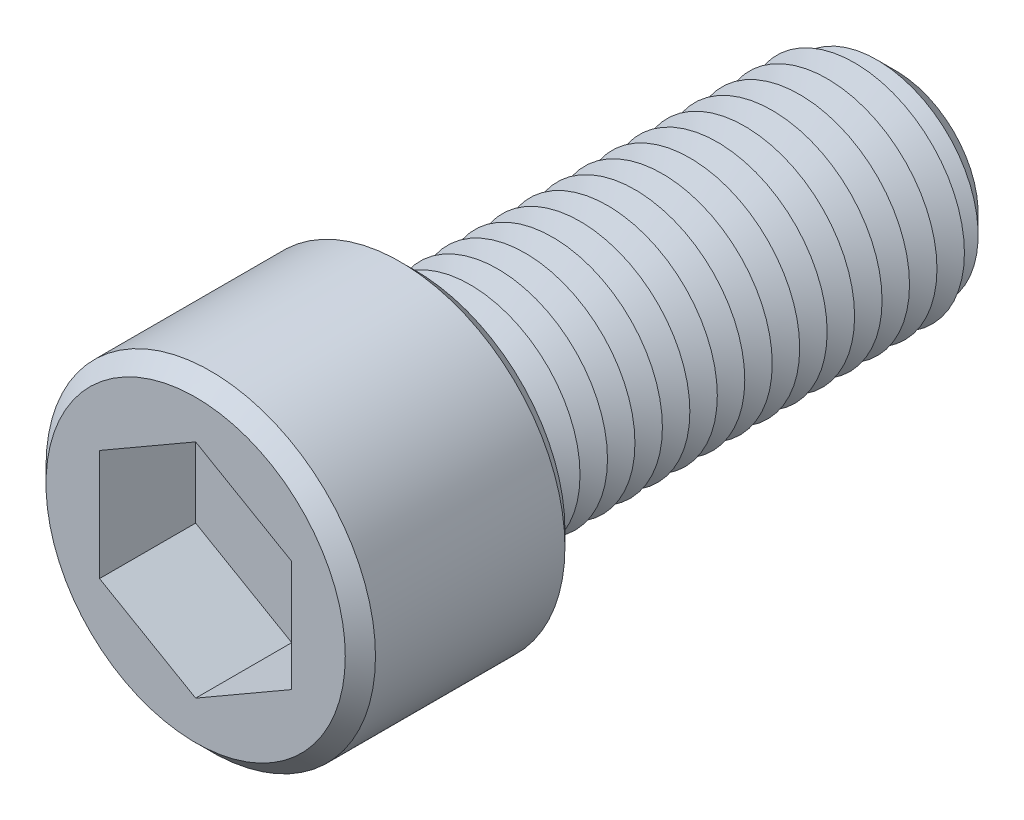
ISO-10303-21;
HEADER;
FILE_DESCRIPTION(('STEP AP214'),'2;1');
FILE_NAME('part.step','',(''),(''),'','','');
FILE_SCHEMA(('AUTOMOTIVE_DESIGN { 1 0 10303 214 1 1 1 1 }'));
ENDSEC;
DATA;
#1=APPLICATION_CONTEXT('core data for automotive mechanical design processes');
#2=APPLICATION_PROTOCOL_DEFINITION('international standard','automotive_design',2000,#1);
#3=PRODUCT_CONTEXT('',#1,'mechanical');
#4=PRODUCT('Part','Part','',(#3));
#5=PRODUCT_RELATED_PRODUCT_CATEGORY('part','',(#4));
#6=PRODUCT_DEFINITION_FORMATION('','',#4);
#7=PRODUCT_DEFINITION_CONTEXT('part definition',#1,'design');
#8=PRODUCT_DEFINITION('design','',#6,#7);
#9=PRODUCT_DEFINITION_SHAPE('','',#8);
#10=(LENGTH_UNIT() NAMED_UNIT(*) SI_UNIT(.MILLI.,.METRE.));
#11=(NAMED_UNIT(*) PLANE_ANGLE_UNIT() SI_UNIT($,.RADIAN.));
#12=(NAMED_UNIT(*) SI_UNIT($,.STERADIAN.) SOLID_ANGLE_UNIT());
#13=UNCERTAINTY_MEASURE_WITH_UNIT(LENGTH_MEASURE(1.E-05),#10,'distance_accuracy_value','');
#14=(GEOMETRIC_REPRESENTATION_CONTEXT(3) GLOBAL_UNCERTAINTY_ASSIGNED_CONTEXT((#13)) GLOBAL_UNIT_ASSIGNED_CONTEXT((#10,
#11,#12)) REPRESENTATION_CONTEXT('',''));
#15=CARTESIAN_POINT('',(0.,0.,0.));
#16=DIRECTION('',(0.,0.,1.));
#17=DIRECTION('',(1.,0.,0.));
#18=AXIS2_PLACEMENT_3D('',#15,#16,#17);
#19=CARTESIAN_POINT('',(0.,0.,16.));
#20=DIRECTION('',(0.,0.,-1.));
#21=DIRECTION('',(-1.,0.,0.));
#22=AXIS2_PLACEMENT_3D('',#19,#20,#21);
#23=CYLINDRICAL_SURFACE('',#22,12.);
#24=CARTESIAN_POINT('',(0.,0.,1.10000000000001));
#25=DIRECTION('',(0.,0.,1.));
#26=DIRECTION('',(1.,0.,0.));
#27=AXIS2_PLACEMENT_3D('',#24,#25,#26);
#28=CIRCLE('',#27,12.);
#29=CARTESIAN_POINT('',(12.,0.,1.10000000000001));
#30=VERTEX_POINT('',#29);
#31=EDGE_CURVE('E312',#30,#30,#28,.T.);
#32=ORIENTED_EDGE('',*,*,#31,.T.);
#33=EDGE_LOOP('',(#32));
#34=FACE_BOUND('',#33,.T.);
#35=CARTESIAN_POINT('',(0.,0.,14.9));
#36=DIRECTION('',(0.,0.,1.));
#37=DIRECTION('',(1.,0.,0.));
#38=AXIS2_PLACEMENT_3D('',#35,#36,#37);
#39=CIRCLE('',#38,12.);
#40=CARTESIAN_POINT('',(12.,0.,14.9));
#41=VERTEX_POINT('',#40);
#42=EDGE_CURVE('E305',#41,#41,#39,.F.);
#43=ORIENTED_EDGE('',*,*,#42,.T.);
#44=EDGE_LOOP('',(#43));
#45=FACE_BOUND('',#44,.T.);
#46=ADVANCED_FACE('F39',(#34,#45),#23,.T.);
#47=CARTESIAN_POINT('',(0.,0.,16.));
#48=DIRECTION('',(0.,0.,1.));
#49=DIRECTION('',(1.,0.,0.));
#50=AXIS2_PLACEMENT_3D('',#47,#48,#49);
#51=PLANE('',#50);
#52=CARTESIAN_POINT('',(0.,0.,16.));
#53=DIRECTION('',(0.,0.,1.));
#54=DIRECTION('',(1.,0.,0.));
#55=AXIS2_PLACEMENT_3D('',#52,#53,#54);
#56=CIRCLE('',#55,10.9);
#57=CARTESIAN_POINT('',(10.9,0.,16.));
#58=VERTEX_POINT('',#57);
#59=EDGE_CURVE('E11',#58,#58,#56,.T.);
#60=ORIENTED_EDGE('',*,*,#59,.T.);
#61=EDGE_LOOP('',(#60));
#62=FACE_BOUND('',#61,.T.);
#63=DIRECTION('',(-0.866025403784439,0.5,0.));
#64=VECTOR('',#63,1.);
#65=CARTESIAN_POINT('',(7.,4.04145188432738,16.));
#66=LINE('',#65,#64);
#67=CARTESIAN_POINT('',(7.,4.04145188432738,16.));
#68=VERTEX_POINT('',#67);
#69=CARTESIAN_POINT('',(0.,8.08290376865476,16.));
#70=VERTEX_POINT('',#69);
#71=EDGE_CURVE('E55',#68,#70,#66,.T.);
#72=ORIENTED_EDGE('',*,*,#71,.F.);
#73=DIRECTION('',(0.,1.,0.));
#74=VECTOR('',#73,1.);
#75=CARTESIAN_POINT('',(7.,-4.04145188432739,16.));
#76=LINE('',#75,#74);
#77=CARTESIAN_POINT('',(7.,-4.04145188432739,16.));
#78=VERTEX_POINT('',#77);
#79=EDGE_CURVE('E151',#78,#68,#76,.T.);
#80=ORIENTED_EDGE('',*,*,#79,.F.);
#81=DIRECTION('',(0.866025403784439,0.5,0.));
#82=VECTOR('',#81,1.);
#83=CARTESIAN_POINT('',(0.,-8.08290376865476,16.));
#84=LINE('',#83,#82);
#85=CARTESIAN_POINT('',(0.,-8.08290376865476,16.));
#86=VERTEX_POINT('',#85);
#87=EDGE_CURVE('E148',#86,#78,#84,.T.);
#88=ORIENTED_EDGE('',*,*,#87,.F.);
#89=DIRECTION('',(0.866025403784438,-0.5,0.));
#90=VECTOR('',#89,1.);
#91=CARTESIAN_POINT('',(-7.,-4.04145188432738,16.));
#92=LINE('',#91,#90);
#93=CARTESIAN_POINT('',(-7.,-4.04145188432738,16.));
#94=VERTEX_POINT('',#93);
#95=EDGE_CURVE('E103',#94,#86,#92,.T.);
#96=ORIENTED_EDGE('',*,*,#95,.F.);
#97=DIRECTION('',(0.,-1.,0.));
#98=VECTOR('',#97,1.);
#99=CARTESIAN_POINT('',(-7.,4.04145188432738,16.));
#100=LINE('',#99,#98);
#101=CARTESIAN_POINT('',(-7.,4.04145188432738,16.));
#102=VERTEX_POINT('',#101);
#103=EDGE_CURVE('E142',#102,#94,#100,.T.);
#104=ORIENTED_EDGE('',*,*,#103,.F.);
#105=DIRECTION('',(-0.866025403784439,-0.5,0.));
#106=VECTOR('',#105,1.);
#107=CARTESIAN_POINT('',(0.,8.08290376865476,16.));
#108=LINE('',#107,#106);
#109=EDGE_CURVE('E137',#70,#102,#108,.T.);
#110=ORIENTED_EDGE('',*,*,#109,.F.);
#111=EDGE_LOOP('',(#72,#80,#88,#96,#104,#110));
#112=FACE_BOUND('',#111,.T.);
#113=ADVANCED_FACE('F331',(#62,#112),#51,.T.);
#114=CARTESIAN_POINT('',(0.,0.,0.));
#115=DIRECTION('',(0.,0.,1.));
#116=DIRECTION('',(1.,0.,0.));
#117=AXIS2_PLACEMENT_3D('',#114,#115,#116);
#118=PLANE('',#117);
#119=CARTESIAN_POINT('',(0.,0.,0.));
#120=DIRECTION('',(0.,0.,1.));
#121=DIRECTION('',(1.,0.,0.));
#122=AXIS2_PLACEMENT_3D('',#119,#120,#121);
#123=CIRCLE('',#122,10.9);
#124=CARTESIAN_POINT('',(10.9,0.,0.));
#125=VERTEX_POINT('',#124);
#126=EDGE_CURVE('E48',#125,#125,#123,.F.);
#127=ORIENTED_EDGE('',*,*,#126,.T.);
#128=EDGE_LOOP('',(#127));
#129=FACE_BOUND('',#128,.T.);
#130=CARTESIAN_POINT('',(0.,0.,0.));
#131=DIRECTION('',(0.,0.,1.));
#132=DIRECTION('',(1.,0.,0.));
#133=AXIS2_PLACEMENT_3D('',#130,#131,#132);
#134=CIRCLE('',#133,8.);
#135=CARTESIAN_POINT('',(8.,0.,0.));
#136=VERTEX_POINT('',#135);
#137=EDGE_CURVE('E297',#136,#136,#134,.T.);
#138=ORIENTED_EDGE('',*,*,#137,.T.);
#139=EDGE_LOOP('',(#138));
#140=FACE_BOUND('',#139,.T.);
#141=ADVANCED_FACE('F320',(#129,#140),#118,.F.);
#142=CARTESIAN_POINT('',(0.,0.,0.));
#143=DIRECTION('',(0.,0.,1.));
#144=DIRECTION('',(1.,0.,0.));
#145=AXIS2_PLACEMENT_3D('',#142,#143,#144);
#146=CONICAL_SURFACE('',#145,8.,1.0471975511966);
#147=CARTESIAN_POINT('',(0.,0.,-1.));
#148=DIRECTION('',(0.,0.,1.));
#149=DIRECTION('',(1.,0.,0.));
#150=AXIS2_PLACEMENT_3D('',#147,#148,#149);
#151=CIRCLE('',#150,6.26794919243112);
#152=CARTESIAN_POINT('',(6.26794919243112,0.,-1.));
#153=VERTEX_POINT('',#152);
#154=EDGE_CURVE('E293',#153,#153,#151,.T.);
#155=ORIENTED_EDGE('',*,*,#154,.T.);
#156=EDGE_LOOP('',(#155));
#157=FACE_BOUND('',#156,.T.);
#158=ORIENTED_EDGE('',*,*,#137,.F.);
#159=EDGE_LOOP('',(#158));
#160=FACE_BOUND('',#159,.T.);
#161=ADVANCED_FACE('F516',(#157,#160),#146,.T.);
#162=CARTESIAN_POINT('',(0.,0.,-1.));
#163=DIRECTION('',(0.,0.,-1.));
#164=DIRECTION('',(-1.,0.,0.));
#165=AXIS2_PLACEMENT_3D('',#162,#163,#164);
#166=CONICAL_SURFACE('',#165,6.26794919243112,1.0471975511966);
#167=CARTESIAN_POINT('',(0.,0.,-2.));
#168=DIRECTION('',(0.,0.,1.));
#169=DIRECTION('',(1.,0.,0.));
#170=AXIS2_PLACEMENT_3D('',#167,#168,#169);
#171=CIRCLE('',#170,8.);
#172=CARTESIAN_POINT('',(8.,0.,-2.));
#173=VERTEX_POINT('',#172);
#174=EDGE_CURVE('E289',#173,#173,#171,.T.);
#175=ORIENTED_EDGE('',*,*,#174,.T.);
#176=EDGE_LOOP('',(#175));
#177=FACE_BOUND('',#176,.T.);
#178=ORIENTED_EDGE('',*,*,#154,.F.);
#179=EDGE_LOOP('',(#178));
#180=FACE_BOUND('',#179,.T.);
#181=ADVANCED_FACE('F512',(#177,#180),#166,.T.);
#182=CARTESIAN_POINT('',(0.,0.,-2.));
#183=DIRECTION('',(0.,0.,1.));
#184=DIRECTION('',(1.,0.,0.));
#185=AXIS2_PLACEMENT_3D('',#182,#183,#184);
#186=CONICAL_SURFACE('',#185,8.,1.0471975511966);
#187=CARTESIAN_POINT('',(0.,0.,-3.));
#188=DIRECTION('',(0.,0.,1.));
#189=DIRECTION('',(1.,0.,0.));
#190=AXIS2_PLACEMENT_3D('',#187,#188,#189);
#191=CIRCLE('',#190,6.26794919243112);
#192=CARTESIAN_POINT('',(6.26794919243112,0.,-3.));
#193=VERTEX_POINT('',#192);
#194=EDGE_CURVE('E285',#193,#193,#191,.T.);
#195=ORIENTED_EDGE('',*,*,#194,.T.);
#196=EDGE_LOOP('',(#195));
#197=FACE_BOUND('',#196,.T.);
#198=ORIENTED_EDGE('',*,*,#174,.F.);
#199=EDGE_LOOP('',(#198));
#200=FACE_BOUND('',#199,.T.);
#201=ADVANCED_FACE('F508',(#197,#200),#186,.T.);
#202=CARTESIAN_POINT('',(0.,0.,-3.));
#203=DIRECTION('',(0.,0.,-1.));
#204=DIRECTION('',(-1.,0.,0.));
#205=AXIS2_PLACEMENT_3D('',#202,#203,#204);
#206=CONICAL_SURFACE('',#205,6.26794919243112,1.0471975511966);
#207=CARTESIAN_POINT('',(0.,0.,-4.));
#208=DIRECTION('',(0.,0.,1.));
#209=DIRECTION('',(1.,0.,0.));
#210=AXIS2_PLACEMENT_3D('',#207,#208,#209);
#211=CIRCLE('',#210,8.);
#212=CARTESIAN_POINT('',(8.,0.,-4.));
#213=VERTEX_POINT('',#212);
#214=EDGE_CURVE('E281',#213,#213,#211,.T.);
#215=ORIENTED_EDGE('',*,*,#214,.T.);
#216=EDGE_LOOP('',(#215));
#217=FACE_BOUND('',#216,.T.);
#218=ORIENTED_EDGE('',*,*,#194,.F.);
#219=EDGE_LOOP('',(#218));
#220=FACE_BOUND('',#219,.T.);
#221=ADVANCED_FACE('F504',(#217,#220),#206,.T.);
#222=CARTESIAN_POINT('',(0.,0.,-4.));
#223=DIRECTION('',(0.,0.,1.));
#224=DIRECTION('',(1.,0.,0.));
#225=AXIS2_PLACEMENT_3D('',#222,#223,#224);
#226=CONICAL_SURFACE('',#225,8.,1.0471975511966);
#227=CARTESIAN_POINT('',(0.,0.,-5.));
#228=DIRECTION('',(0.,0.,1.));
#229=DIRECTION('',(1.,0.,0.));
#230=AXIS2_PLACEMENT_3D('',#227,#228,#229);
#231=CIRCLE('',#230,6.26794919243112);
#232=CARTESIAN_POINT('',(6.26794919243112,0.,-5.));
#233=VERTEX_POINT('',#232);
#234=EDGE_CURVE('E277',#233,#233,#231,.T.);
#235=ORIENTED_EDGE('',*,*,#234,.T.);
#236=EDGE_LOOP('',(#235));
#237=FACE_BOUND('',#236,.T.);
#238=ORIENTED_EDGE('',*,*,#214,.F.);
#239=EDGE_LOOP('',(#238));
#240=FACE_BOUND('',#239,.T.);
#241=ADVANCED_FACE('F500',(#237,#240),#226,.T.);
#242=CARTESIAN_POINT('',(0.,0.,-5.));
#243=DIRECTION('',(0.,0.,-1.));
#244=DIRECTION('',(-1.,0.,0.));
#245=AXIS2_PLACEMENT_3D('',#242,#243,#244);
#246=CONICAL_SURFACE('',#245,6.26794919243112,1.0471975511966);
#247=CARTESIAN_POINT('',(0.,0.,-6.));
#248=DIRECTION('',(0.,0.,1.));
#249=DIRECTION('',(1.,0.,0.));
#250=AXIS2_PLACEMENT_3D('',#247,#248,#249);
#251=CIRCLE('',#250,8.);
#252=CARTESIAN_POINT('',(8.,0.,-6.));
#253=VERTEX_POINT('',#252);
#254=EDGE_CURVE('E273',#253,#253,#251,.T.);
#255=ORIENTED_EDGE('',*,*,#254,.T.);
#256=EDGE_LOOP('',(#255));
#257=FACE_BOUND('',#256,.T.);
#258=ORIENTED_EDGE('',*,*,#234,.F.);
#259=EDGE_LOOP('',(#258));
#260=FACE_BOUND('',#259,.T.);
#261=ADVANCED_FACE('F496',(#257,#260),#246,.T.);
#262=CARTESIAN_POINT('',(0.,0.,-6.));
#263=DIRECTION('',(0.,0.,1.));
#264=DIRECTION('',(1.,0.,0.));
#265=AXIS2_PLACEMENT_3D('',#262,#263,#264);
#266=CONICAL_SURFACE('',#265,8.,1.0471975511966);
#267=CARTESIAN_POINT('',(0.,0.,-7.));
#268=DIRECTION('',(0.,0.,1.));
#269=DIRECTION('',(1.,0.,0.));
#270=AXIS2_PLACEMENT_3D('',#267,#268,#269);
#271=CIRCLE('',#270,6.26794919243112);
#272=CARTESIAN_POINT('',(6.26794919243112,0.,-7.));
#273=VERTEX_POINT('',#272);
#274=EDGE_CURVE('E269',#273,#273,#271,.T.);
#275=ORIENTED_EDGE('',*,*,#274,.T.);
#276=EDGE_LOOP('',(#275));
#277=FACE_BOUND('',#276,.T.);
#278=ORIENTED_EDGE('',*,*,#254,.F.);
#279=EDGE_LOOP('',(#278));
#280=FACE_BOUND('',#279,.T.);
#281=ADVANCED_FACE('F492',(#277,#280),#266,.T.);
#282=CARTESIAN_POINT('',(0.,0.,-7.));
#283=DIRECTION('',(0.,0.,-1.));
#284=DIRECTION('',(-1.,0.,0.));
#285=AXIS2_PLACEMENT_3D('',#282,#283,#284);
#286=CONICAL_SURFACE('',#285,6.26794919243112,1.0471975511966);
#287=CARTESIAN_POINT('',(0.,0.,-8.));
#288=DIRECTION('',(0.,0.,1.));
#289=DIRECTION('',(1.,0.,0.));
#290=AXIS2_PLACEMENT_3D('',#287,#288,#289);
#291=CIRCLE('',#290,8.);
#292=CARTESIAN_POINT('',(8.,0.,-8.));
#293=VERTEX_POINT('',#292);
#294=EDGE_CURVE('E265',#293,#293,#291,.T.);
#295=ORIENTED_EDGE('',*,*,#294,.T.);
#296=EDGE_LOOP('',(#295));
#297=FACE_BOUND('',#296,.T.);
#298=ORIENTED_EDGE('',*,*,#274,.F.);
#299=EDGE_LOOP('',(#298));
#300=FACE_BOUND('',#299,.T.);
#301=ADVANCED_FACE('F488',(#297,#300),#286,.T.);
#302=CARTESIAN_POINT('',(0.,0.,-8.));
#303=DIRECTION('',(0.,0.,1.));
#304=DIRECTION('',(1.,0.,0.));
#305=AXIS2_PLACEMENT_3D('',#302,#303,#304);
#306=CONICAL_SURFACE('',#305,8.,1.0471975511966);
#307=CARTESIAN_POINT('',(0.,0.,-9.));
#308=DIRECTION('',(0.,0.,1.));
#309=DIRECTION('',(1.,0.,0.));
#310=AXIS2_PLACEMENT_3D('',#307,#308,#309);
#311=CIRCLE('',#310,6.26794919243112);
#312=CARTESIAN_POINT('',(6.26794919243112,0.,-9.));
#313=VERTEX_POINT('',#312);
#314=EDGE_CURVE('E261',#313,#313,#311,.T.);
#315=ORIENTED_EDGE('',*,*,#314,.T.);
#316=EDGE_LOOP('',(#315));
#317=FACE_BOUND('',#316,.T.);
#318=ORIENTED_EDGE('',*,*,#294,.F.);
#319=EDGE_LOOP('',(#318));
#320=FACE_BOUND('',#319,.T.);
#321=ADVANCED_FACE('F484',(#317,#320),#306,.T.);
#322=CARTESIAN_POINT('',(0.,0.,-9.));
#323=DIRECTION('',(0.,0.,-1.));
#324=DIRECTION('',(-1.,0.,0.));
#325=AXIS2_PLACEMENT_3D('',#322,#323,#324);
#326=CONICAL_SURFACE('',#325,6.26794919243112,1.0471975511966);
#327=CARTESIAN_POINT('',(0.,0.,-10.));
#328=DIRECTION('',(0.,0.,1.));
#329=DIRECTION('',(1.,0.,0.));
#330=AXIS2_PLACEMENT_3D('',#327,#328,#329);
#331=CIRCLE('',#330,8.);
#332=CARTESIAN_POINT('',(8.,0.,-10.));
#333=VERTEX_POINT('',#332);
#334=EDGE_CURVE('E257',#333,#333,#331,.T.);
#335=ORIENTED_EDGE('',*,*,#334,.T.);
#336=EDGE_LOOP('',(#335));
#337=FACE_BOUND('',#336,.T.);
#338=ORIENTED_EDGE('',*,*,#314,.F.);
#339=EDGE_LOOP('',(#338));
#340=FACE_BOUND('',#339,.T.);
#341=ADVANCED_FACE('F480',(#337,#340),#326,.T.);
#342=CARTESIAN_POINT('',(0.,0.,-10.));
#343=DIRECTION('',(0.,0.,1.));
#344=DIRECTION('',(1.,0.,0.));
#345=AXIS2_PLACEMENT_3D('',#342,#343,#344);
#346=CONICAL_SURFACE('',#345,8.,1.0471975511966);
#347=CARTESIAN_POINT('',(0.,0.,-11.));
#348=DIRECTION('',(0.,0.,1.));
#349=DIRECTION('',(1.,0.,0.));
#350=AXIS2_PLACEMENT_3D('',#347,#348,#349);
#351=CIRCLE('',#350,6.26794919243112);
#352=CARTESIAN_POINT('',(6.26794919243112,0.,-11.));
#353=VERTEX_POINT('',#352);
#354=EDGE_CURVE('E253',#353,#353,#351,.T.);
#355=ORIENTED_EDGE('',*,*,#354,.T.);
#356=EDGE_LOOP('',(#355));
#357=FACE_BOUND('',#356,.T.);
#358=ORIENTED_EDGE('',*,*,#334,.F.);
#359=EDGE_LOOP('',(#358));
#360=FACE_BOUND('',#359,.T.);
#361=ADVANCED_FACE('F476',(#357,#360),#346,.T.);
#362=CARTESIAN_POINT('',(0.,0.,-11.));
#363=DIRECTION('',(0.,0.,-1.));
#364=DIRECTION('',(-1.,0.,0.));
#365=AXIS2_PLACEMENT_3D('',#362,#363,#364);
#366=CONICAL_SURFACE('',#365,6.26794919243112,1.0471975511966);
#367=CARTESIAN_POINT('',(0.,0.,-12.));
#368=DIRECTION('',(0.,0.,1.));
#369=DIRECTION('',(1.,0.,0.));
#370=AXIS2_PLACEMENT_3D('',#367,#368,#369);
#371=CIRCLE('',#370,8.);
#372=CARTESIAN_POINT('',(8.,0.,-12.));
#373=VERTEX_POINT('',#372);
#374=EDGE_CURVE('E249',#373,#373,#371,.T.);
#375=ORIENTED_EDGE('',*,*,#374,.T.);
#376=EDGE_LOOP('',(#375));
#377=FACE_BOUND('',#376,.T.);
#378=ORIENTED_EDGE('',*,*,#354,.F.);
#379=EDGE_LOOP('',(#378));
#380=FACE_BOUND('',#379,.T.);
#381=ADVANCED_FACE('F472',(#377,#380),#366,.T.);
#382=CARTESIAN_POINT('',(0.,0.,-12.));
#383=DIRECTION('',(0.,0.,1.));
#384=DIRECTION('',(1.,0.,0.));
#385=AXIS2_PLACEMENT_3D('',#382,#383,#384);
#386=CONICAL_SURFACE('',#385,8.,1.0471975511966);
#387=CARTESIAN_POINT('',(0.,0.,-13.));
#388=DIRECTION('',(0.,0.,1.));
#389=DIRECTION('',(1.,0.,0.));
#390=AXIS2_PLACEMENT_3D('',#387,#388,#389);
#391=CIRCLE('',#390,6.26794919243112);
#392=CARTESIAN_POINT('',(6.26794919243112,0.,-13.));
#393=VERTEX_POINT('',#392);
#394=EDGE_CURVE('E245',#393,#393,#391,.T.);
#395=ORIENTED_EDGE('',*,*,#394,.T.);
#396=EDGE_LOOP('',(#395));
#397=FACE_BOUND('',#396,.T.);
#398=ORIENTED_EDGE('',*,*,#374,.F.);
#399=EDGE_LOOP('',(#398));
#400=FACE_BOUND('',#399,.T.);
#401=ADVANCED_FACE('F468',(#397,#400),#386,.T.);
#402=CARTESIAN_POINT('',(0.,0.,-13.));
#403=DIRECTION('',(0.,0.,-1.));
#404=DIRECTION('',(-1.,0.,0.));
#405=AXIS2_PLACEMENT_3D('',#402,#403,#404);
#406=CONICAL_SURFACE('',#405,6.26794919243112,1.0471975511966);
#407=CARTESIAN_POINT('',(0.,0.,-14.));
#408=DIRECTION('',(0.,0.,1.));
#409=DIRECTION('',(1.,0.,0.));
#410=AXIS2_PLACEMENT_3D('',#407,#408,#409);
#411=CIRCLE('',#410,8.);
#412=CARTESIAN_POINT('',(8.,0.,-14.));
#413=VERTEX_POINT('',#412);
#414=EDGE_CURVE('E241',#413,#413,#411,.T.);
#415=ORIENTED_EDGE('',*,*,#414,.T.);
#416=EDGE_LOOP('',(#415));
#417=FACE_BOUND('',#416,.T.);
#418=ORIENTED_EDGE('',*,*,#394,.F.);
#419=EDGE_LOOP('',(#418));
#420=FACE_BOUND('',#419,.T.);
#421=ADVANCED_FACE('F464',(#417,#420),#406,.T.);
#422=CARTESIAN_POINT('',(0.,0.,-14.));
#423=DIRECTION('',(0.,0.,1.));
#424=DIRECTION('',(1.,0.,0.));
#425=AXIS2_PLACEMENT_3D('',#422,#423,#424);
#426=CONICAL_SURFACE('',#425,8.,1.0471975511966);
#427=CARTESIAN_POINT('',(0.,0.,-15.));
#428=DIRECTION('',(0.,0.,1.));
#429=DIRECTION('',(1.,0.,0.));
#430=AXIS2_PLACEMENT_3D('',#427,#428,#429);
#431=CIRCLE('',#430,6.26794919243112);
#432=CARTESIAN_POINT('',(6.26794919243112,0.,-15.));
#433=VERTEX_POINT('',#432);
#434=EDGE_CURVE('E237',#433,#433,#431,.T.);
#435=ORIENTED_EDGE('',*,*,#434,.T.);
#436=EDGE_LOOP('',(#435));
#437=FACE_BOUND('',#436,.T.);
#438=ORIENTED_EDGE('',*,*,#414,.F.);
#439=EDGE_LOOP('',(#438));
#440=FACE_BOUND('',#439,.T.);
#441=ADVANCED_FACE('F460',(#437,#440),#426,.T.);
#442=CARTESIAN_POINT('',(0.,0.,-15.));
#443=DIRECTION('',(0.,0.,-1.));
#444=DIRECTION('',(-1.,0.,0.));
#445=AXIS2_PLACEMENT_3D('',#442,#443,#444);
#446=CONICAL_SURFACE('',#445,6.26794919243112,1.0471975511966);
#447=CARTESIAN_POINT('',(0.,0.,-16.));
#448=DIRECTION('',(0.,0.,1.));
#449=DIRECTION('',(1.,0.,0.));
#450=AXIS2_PLACEMENT_3D('',#447,#448,#449);
#451=CIRCLE('',#450,8.);
#452=CARTESIAN_POINT('',(8.,0.,-16.));
#453=VERTEX_POINT('',#452);
#454=EDGE_CURVE('E233',#453,#453,#451,.T.);
#455=ORIENTED_EDGE('',*,*,#454,.T.);
#456=EDGE_LOOP('',(#455));
#457=FACE_BOUND('',#456,.T.);
#458=ORIENTED_EDGE('',*,*,#434,.F.);
#459=EDGE_LOOP('',(#458));
#460=FACE_BOUND('',#459,.T.);
#461=ADVANCED_FACE('F456',(#457,#460),#446,.T.);
#462=CARTESIAN_POINT('',(0.,0.,-16.));
#463=DIRECTION('',(0.,0.,1.));
#464=DIRECTION('',(1.,0.,0.));
#465=AXIS2_PLACEMENT_3D('',#462,#463,#464);
#466=CONICAL_SURFACE('',#465,8.,1.0471975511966);
#467=CARTESIAN_POINT('',(0.,0.,-17.));
#468=DIRECTION('',(0.,0.,1.));
#469=DIRECTION('',(1.,0.,0.));
#470=AXIS2_PLACEMENT_3D('',#467,#468,#469);
#471=CIRCLE('',#470,6.26794919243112);
#472=CARTESIAN_POINT('',(6.26794919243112,0.,-17.));
#473=VERTEX_POINT('',#472);
#474=EDGE_CURVE('E229',#473,#473,#471,.T.);
#475=ORIENTED_EDGE('',*,*,#474,.T.);
#476=EDGE_LOOP('',(#475));
#477=FACE_BOUND('',#476,.T.);
#478=ORIENTED_EDGE('',*,*,#454,.F.);
#479=EDGE_LOOP('',(#478));
#480=FACE_BOUND('',#479,.T.);
#481=ADVANCED_FACE('F452',(#477,#480),#466,.T.);
#482=CARTESIAN_POINT('',(0.,0.,-17.));
#483=DIRECTION('',(0.,0.,-1.));
#484=DIRECTION('',(-1.,0.,0.));
#485=AXIS2_PLACEMENT_3D('',#482,#483,#484);
#486=CONICAL_SURFACE('',#485,6.26794919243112,1.0471975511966);
#487=CARTESIAN_POINT('',(0.,0.,-18.));
#488=DIRECTION('',(0.,0.,1.));
#489=DIRECTION('',(1.,0.,0.));
#490=AXIS2_PLACEMENT_3D('',#487,#488,#489);
#491=CIRCLE('',#490,8.);
#492=CARTESIAN_POINT('',(8.,0.,-18.));
#493=VERTEX_POINT('',#492);
#494=EDGE_CURVE('E225',#493,#493,#491,.T.);
#495=ORIENTED_EDGE('',*,*,#494,.T.);
#496=EDGE_LOOP('',(#495));
#497=FACE_BOUND('',#496,.T.);
#498=ORIENTED_EDGE('',*,*,#474,.F.);
#499=EDGE_LOOP('',(#498));
#500=FACE_BOUND('',#499,.T.);
#501=ADVANCED_FACE('F448',(#497,#500),#486,.T.);
#502=CARTESIAN_POINT('',(0.,0.,-18.));
#503=DIRECTION('',(0.,0.,1.));
#504=DIRECTION('',(1.,0.,0.));
#505=AXIS2_PLACEMENT_3D('',#502,#503,#504);
#506=CONICAL_SURFACE('',#505,8.,1.0471975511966);
#507=CARTESIAN_POINT('',(0.,0.,-19.));
#508=DIRECTION('',(0.,0.,1.));
#509=DIRECTION('',(1.,0.,0.));
#510=AXIS2_PLACEMENT_3D('',#507,#508,#509);
#511=CIRCLE('',#510,6.26794919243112);
#512=CARTESIAN_POINT('',(6.26794919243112,0.,-19.));
#513=VERTEX_POINT('',#512);
#514=EDGE_CURVE('E221',#513,#513,#511,.T.);
#515=ORIENTED_EDGE('',*,*,#514,.T.);
#516=EDGE_LOOP('',(#515));
#517=FACE_BOUND('',#516,.T.);
#518=ORIENTED_EDGE('',*,*,#494,.F.);
#519=EDGE_LOOP('',(#518));
#520=FACE_BOUND('',#519,.T.);
#521=ADVANCED_FACE('F444',(#517,#520),#506,.T.);
#522=CARTESIAN_POINT('',(0.,0.,-19.));
#523=DIRECTION('',(0.,0.,-1.));
#524=DIRECTION('',(-1.,0.,0.));
#525=AXIS2_PLACEMENT_3D('',#522,#523,#524);
#526=CONICAL_SURFACE('',#525,6.26794919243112,1.0471975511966);
#527=CARTESIAN_POINT('',(0.,0.,-20.));
#528=DIRECTION('',(0.,0.,1.));
#529=DIRECTION('',(1.,0.,0.));
#530=AXIS2_PLACEMENT_3D('',#527,#528,#529);
#531=CIRCLE('',#530,8.);
#532=CARTESIAN_POINT('',(8.,0.,-20.));
#533=VERTEX_POINT('',#532);
#534=EDGE_CURVE('E217',#533,#533,#531,.T.);
#535=ORIENTED_EDGE('',*,*,#534,.T.);
#536=EDGE_LOOP('',(#535));
#537=FACE_BOUND('',#536,.T.);
#538=ORIENTED_EDGE('',*,*,#514,.F.);
#539=EDGE_LOOP('',(#538));
#540=FACE_BOUND('',#539,.T.);
#541=ADVANCED_FACE('F440',(#537,#540),#526,.T.);
#542=CARTESIAN_POINT('',(0.,0.,-20.));
#543=DIRECTION('',(0.,0.,1.));
#544=DIRECTION('',(1.,0.,0.));
#545=AXIS2_PLACEMENT_3D('',#542,#543,#544);
#546=CONICAL_SURFACE('',#545,8.,1.0471975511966);
#547=CARTESIAN_POINT('',(0.,0.,-21.));
#548=DIRECTION('',(0.,0.,1.));
#549=DIRECTION('',(1.,0.,0.));
#550=AXIS2_PLACEMENT_3D('',#547,#548,#549);
#551=CIRCLE('',#550,6.26794919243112);
#552=CARTESIAN_POINT('',(6.26794919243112,0.,-21.));
#553=VERTEX_POINT('',#552);
#554=EDGE_CURVE('E213',#553,#553,#551,.T.);
#555=ORIENTED_EDGE('',*,*,#554,.T.);
#556=EDGE_LOOP('',(#555));
#557=FACE_BOUND('',#556,.T.);
#558=ORIENTED_EDGE('',*,*,#534,.F.);
#559=EDGE_LOOP('',(#558));
#560=FACE_BOUND('',#559,.T.);
#561=ADVANCED_FACE('F436',(#557,#560),#546,.T.);
#562=CARTESIAN_POINT('',(0.,0.,-21.));
#563=DIRECTION('',(0.,0.,-1.));
#564=DIRECTION('',(-1.,0.,0.));
#565=AXIS2_PLACEMENT_3D('',#562,#563,#564);
#566=CONICAL_SURFACE('',#565,6.26794919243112,1.0471975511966);
#567=CARTESIAN_POINT('',(0.,0.,-22.));
#568=DIRECTION('',(0.,0.,1.));
#569=DIRECTION('',(1.,0.,0.));
#570=AXIS2_PLACEMENT_3D('',#567,#568,#569);
#571=CIRCLE('',#570,8.);
#572=CARTESIAN_POINT('',(8.,0.,-22.));
#573=VERTEX_POINT('',#572);
#574=EDGE_CURVE('E209',#573,#573,#571,.T.);
#575=ORIENTED_EDGE('',*,*,#574,.T.);
#576=EDGE_LOOP('',(#575));
#577=FACE_BOUND('',#576,.T.);
#578=ORIENTED_EDGE('',*,*,#554,.F.);
#579=EDGE_LOOP('',(#578));
#580=FACE_BOUND('',#579,.T.);
#581=ADVANCED_FACE('F432',(#577,#580),#566,.T.);
#582=CARTESIAN_POINT('',(0.,0.,-22.));
#583=DIRECTION('',(0.,0.,1.));
#584=DIRECTION('',(1.,0.,0.));
#585=AXIS2_PLACEMENT_3D('',#582,#583,#584);
#586=CONICAL_SURFACE('',#585,8.,1.0471975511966);
#587=CARTESIAN_POINT('',(0.,0.,-23.));
#588=DIRECTION('',(0.,0.,1.));
#589=DIRECTION('',(1.,0.,0.));
#590=AXIS2_PLACEMENT_3D('',#587,#588,#589);
#591=CIRCLE('',#590,6.26794919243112);
#592=CARTESIAN_POINT('',(6.26794919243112,0.,-23.));
#593=VERTEX_POINT('',#592);
#594=EDGE_CURVE('E205',#593,#593,#591,.T.);
#595=ORIENTED_EDGE('',*,*,#594,.T.);
#596=EDGE_LOOP('',(#595));
#597=FACE_BOUND('',#596,.T.);
#598=ORIENTED_EDGE('',*,*,#574,.F.);
#599=EDGE_LOOP('',(#598));
#600=FACE_BOUND('',#599,.T.);
#601=ADVANCED_FACE('F428',(#597,#600),#586,.T.);
#602=CARTESIAN_POINT('',(0.,0.,-23.));
#603=DIRECTION('',(0.,0.,-1.));
#604=DIRECTION('',(-1.,0.,0.));
#605=AXIS2_PLACEMENT_3D('',#602,#603,#604);
#606=CONICAL_SURFACE('',#605,6.26794919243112,1.0471975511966);
#607=CARTESIAN_POINT('',(0.,0.,-24.));
#608=DIRECTION('',(0.,0.,1.));
#609=DIRECTION('',(1.,0.,0.));
#610=AXIS2_PLACEMENT_3D('',#607,#608,#609);
#611=CIRCLE('',#610,8.);
#612=CARTESIAN_POINT('',(8.,0.,-24.));
#613=VERTEX_POINT('',#612);
#614=EDGE_CURVE('E201',#613,#613,#611,.T.);
#615=ORIENTED_EDGE('',*,*,#614,.T.);
#616=EDGE_LOOP('',(#615));
#617=FACE_BOUND('',#616,.T.);
#618=ORIENTED_EDGE('',*,*,#594,.F.);
#619=EDGE_LOOP('',(#618));
#620=FACE_BOUND('',#619,.T.);
#621=ADVANCED_FACE('F424',(#617,#620),#606,.T.);
#622=CARTESIAN_POINT('',(0.,0.,-24.));
#623=DIRECTION('',(0.,0.,1.));
#624=DIRECTION('',(1.,0.,0.));
#625=AXIS2_PLACEMENT_3D('',#622,#623,#624);
#626=CONICAL_SURFACE('',#625,8.,1.0471975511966);
#627=CARTESIAN_POINT('',(0.,0.,-25.));
#628=DIRECTION('',(0.,0.,1.));
#629=DIRECTION('',(1.,0.,0.));
#630=AXIS2_PLACEMENT_3D('',#627,#628,#629);
#631=CIRCLE('',#630,6.26794919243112);
#632=CARTESIAN_POINT('',(6.26794919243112,0.,-25.));
#633=VERTEX_POINT('',#632);
#634=EDGE_CURVE('E197',#633,#633,#631,.T.);
#635=ORIENTED_EDGE('',*,*,#634,.T.);
#636=EDGE_LOOP('',(#635));
#637=FACE_BOUND('',#636,.T.);
#638=ORIENTED_EDGE('',*,*,#614,.F.);
#639=EDGE_LOOP('',(#638));
#640=FACE_BOUND('',#639,.T.);
#641=ADVANCED_FACE('F420',(#637,#640),#626,.T.);
#642=CARTESIAN_POINT('',(0.,0.,-25.));
#643=DIRECTION('',(0.,0.,-1.));
#644=DIRECTION('',(-1.,0.,0.));
#645=AXIS2_PLACEMENT_3D('',#642,#643,#644);
#646=CONICAL_SURFACE('',#645,6.26794919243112,1.0471975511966);
#647=CARTESIAN_POINT('',(0.,0.,-26.));
#648=DIRECTION('',(0.,0.,1.));
#649=DIRECTION('',(1.,0.,0.));
#650=AXIS2_PLACEMENT_3D('',#647,#648,#649);
#651=CIRCLE('',#650,8.);
#652=CARTESIAN_POINT('',(8.,0.,-26.));
#653=VERTEX_POINT('',#652);
#654=EDGE_CURVE('E193',#653,#653,#651,.T.);
#655=ORIENTED_EDGE('',*,*,#654,.T.);
#656=EDGE_LOOP('',(#655));
#657=FACE_BOUND('',#656,.T.);
#658=ORIENTED_EDGE('',*,*,#634,.F.);
#659=EDGE_LOOP('',(#658));
#660=FACE_BOUND('',#659,.T.);
#661=ADVANCED_FACE('F416',(#657,#660),#646,.T.);
#662=CARTESIAN_POINT('',(0.,0.,-26.));
#663=DIRECTION('',(0.,0.,1.));
#664=DIRECTION('',(1.,0.,0.));
#665=AXIS2_PLACEMENT_3D('',#662,#663,#664);
#666=CONICAL_SURFACE('',#665,8.,1.0471975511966);
#667=CARTESIAN_POINT('',(0.,0.,-27.));
#668=DIRECTION('',(0.,0.,1.));
#669=DIRECTION('',(1.,0.,0.));
#670=AXIS2_PLACEMENT_3D('',#667,#668,#669);
#671=CIRCLE('',#670,6.26794919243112);
#672=CARTESIAN_POINT('',(6.26794919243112,0.,-27.));
#673=VERTEX_POINT('',#672);
#674=EDGE_CURVE('E189',#673,#673,#671,.T.);
#675=ORIENTED_EDGE('',*,*,#674,.T.);
#676=EDGE_LOOP('',(#675));
#677=FACE_BOUND('',#676,.T.);
#678=ORIENTED_EDGE('',*,*,#654,.F.);
#679=EDGE_LOOP('',(#678));
#680=FACE_BOUND('',#679,.T.);
#681=ADVANCED_FACE('F412',(#677,#680),#666,.T.);
#682=CARTESIAN_POINT('',(0.,0.,-27.));
#683=DIRECTION('',(0.,0.,-1.));
#684=DIRECTION('',(-1.,0.,0.));
#685=AXIS2_PLACEMENT_3D('',#682,#683,#684);
#686=CONICAL_SURFACE('',#685,6.26794919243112,1.0471975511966);
#687=CARTESIAN_POINT('',(0.,0.,-28.));
#688=DIRECTION('',(0.,0.,1.));
#689=DIRECTION('',(1.,0.,0.));
#690=AXIS2_PLACEMENT_3D('',#687,#688,#689);
#691=CIRCLE('',#690,8.);
#692=CARTESIAN_POINT('',(8.,0.,-28.));
#693=VERTEX_POINT('',#692);
#694=EDGE_CURVE('E186',#693,#693,#691,.T.);
#695=ORIENTED_EDGE('',*,*,#694,.T.);
#696=EDGE_LOOP('',(#695));
#697=FACE_BOUND('',#696,.T.);
#698=ORIENTED_EDGE('',*,*,#674,.F.);
#699=EDGE_LOOP('',(#698));
#700=FACE_BOUND('',#699,.T.);
#701=ADVANCED_FACE('F408',(#697,#700),#686,.T.);
#702=CARTESIAN_POINT('',(0.,0.,-28.));
#703=DIRECTION('',(0.,0.,1.));
#704=DIRECTION('',(1.,0.,0.));
#705=AXIS2_PLACEMENT_3D('',#702,#703,#704);
#706=CONICAL_SURFACE('',#705,8.,1.0471975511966);
#707=CARTESIAN_POINT('',(0.,0.,-29.));
#708=DIRECTION('',(0.,0.,1.));
#709=DIRECTION('',(1.,0.,0.));
#710=AXIS2_PLACEMENT_3D('',#707,#708,#709);
#711=CIRCLE('',#710,6.26794919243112);
#712=CARTESIAN_POINT('',(6.26794919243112,0.,-29.));
#713=VERTEX_POINT('',#712);
#714=EDGE_CURVE('E182',#713,#713,#711,.T.);
#715=ORIENTED_EDGE('',*,*,#714,.T.);
#716=EDGE_LOOP('',(#715));
#717=FACE_BOUND('',#716,.T.);
#718=ORIENTED_EDGE('',*,*,#694,.F.);
#719=EDGE_LOOP('',(#718));
#720=FACE_BOUND('',#719,.T.);
#721=ADVANCED_FACE('F404',(#717,#720),#706,.T.);
#722=CARTESIAN_POINT('',(0.,0.,-29.));
#723=DIRECTION('',(0.,0.,-1.));
#724=DIRECTION('',(-1.,0.,0.));
#725=AXIS2_PLACEMENT_3D('',#722,#723,#724);
#726=CONICAL_SURFACE('',#725,6.26794919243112,1.0471975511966);
#727=CARTESIAN_POINT('',(0.,0.,-30.));
#728=DIRECTION('',(0.,0.,1.));
#729=DIRECTION('',(1.,0.,0.));
#730=AXIS2_PLACEMENT_3D('',#727,#728,#729);
#731=CIRCLE('',#730,8.);
#732=CARTESIAN_POINT('',(8.,0.,-30.));
#733=VERTEX_POINT('',#732);
#734=EDGE_CURVE('E178',#733,#733,#731,.T.);
#735=ORIENTED_EDGE('',*,*,#734,.T.);
#736=EDGE_LOOP('',(#735));
#737=FACE_BOUND('',#736,.T.);
#738=ORIENTED_EDGE('',*,*,#714,.F.);
#739=EDGE_LOOP('',(#738));
#740=FACE_BOUND('',#739,.T.);
#741=ADVANCED_FACE('F400',(#737,#740),#726,.T.);
#742=CARTESIAN_POINT('',(0.,0.,-30.));
#743=DIRECTION('',(0.,0.,1.));
#744=DIRECTION('',(1.,0.,0.));
#745=AXIS2_PLACEMENT_3D('',#742,#743,#744);
#746=CONICAL_SURFACE('',#745,8.,1.0471975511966);
#747=CARTESIAN_POINT('',(0.,0.,-31.));
#748=DIRECTION('',(0.,0.,1.));
#749=DIRECTION('',(1.,0.,0.));
#750=AXIS2_PLACEMENT_3D('',#747,#748,#749);
#751=CIRCLE('',#750,6.26794919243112);
#752=CARTESIAN_POINT('',(6.26794919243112,0.,-31.));
#753=VERTEX_POINT('',#752);
#754=EDGE_CURVE('E174',#753,#753,#751,.T.);
#755=ORIENTED_EDGE('',*,*,#754,.T.);
#756=EDGE_LOOP('',(#755));
#757=FACE_BOUND('',#756,.T.);
#758=ORIENTED_EDGE('',*,*,#734,.F.);
#759=EDGE_LOOP('',(#758));
#760=FACE_BOUND('',#759,.T.);
#761=ADVANCED_FACE('F396',(#757,#760),#746,.T.);
#762=CARTESIAN_POINT('',(0.,0.,-31.));
#763=DIRECTION('',(0.,0.,-1.));
#764=DIRECTION('',(-1.,0.,0.));
#765=AXIS2_PLACEMENT_3D('',#762,#763,#764);
#766=CONICAL_SURFACE('',#765,6.26794919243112,1.0471975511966);
#767=CARTESIAN_POINT('',(0.,0.,-32.));
#768=DIRECTION('',(0.,0.,1.));
#769=DIRECTION('',(1.,0.,0.));
#770=AXIS2_PLACEMENT_3D('',#767,#768,#769);
#771=CIRCLE('',#770,8.);
#772=CARTESIAN_POINT('',(8.,0.,-32.));
#773=VERTEX_POINT('',#772);
#774=EDGE_CURVE('E169',#773,#773,#771,.T.);
#775=ORIENTED_EDGE('',*,*,#774,.T.);
#776=EDGE_LOOP('',(#775));
#777=FACE_BOUND('',#776,.T.);
#778=ORIENTED_EDGE('',*,*,#754,.F.);
#779=EDGE_LOOP('',(#778));
#780=FACE_BOUND('',#779,.T.);
#781=ADVANCED_FACE('F392',(#777,#780),#766,.T.);
#782=CARTESIAN_POINT('',(0.,0.,-32.));
#783=DIRECTION('',(0.,0.,1.));
#784=DIRECTION('',(1.,0.,0.));
#785=AXIS2_PLACEMENT_3D('',#782,#783,#784);
#786=CONICAL_SURFACE('',#785,8.,1.0471975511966);
#787=CARTESIAN_POINT('',(0.,0.,-33.));
#788=DIRECTION('',(0.,0.,1.));
#789=DIRECTION('',(1.,0.,0.));
#790=AXIS2_PLACEMENT_3D('',#787,#788,#789);
#791=CIRCLE('',#790,6.26794919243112);
#792=CARTESIAN_POINT('',(6.26794919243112,0.,-33.));
#793=VERTEX_POINT('',#792);
#794=EDGE_CURVE('E157',#793,#793,#791,.T.);
#795=ORIENTED_EDGE('',*,*,#794,.T.);
#796=EDGE_LOOP('',(#795));
#797=FACE_BOUND('',#796,.T.);
#798=ORIENTED_EDGE('',*,*,#774,.F.);
#799=EDGE_LOOP('',(#798));
#800=FACE_BOUND('',#799,.T.);
#801=ADVANCED_FACE('F388',(#797,#800),#786,.T.);
#802=CARTESIAN_POINT('',(0.,0.,-33.));
#803=DIRECTION('',(0.,0.,-1.));
#804=DIRECTION('',(-1.,0.,0.));
#805=AXIS2_PLACEMENT_3D('',#802,#803,#804);
#806=CONICAL_SURFACE('',#805,6.26794919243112,1.0471975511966);
#807=CARTESIAN_POINT('',(0.,0.,-33.6339745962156));
#808=DIRECTION('',(0.,0.,-1.));
#809=DIRECTION('',(-1.,0.,0.));
#810=AXIS2_PLACEMENT_3D('',#807,#808,#809);
#811=CIRCLE('',#810,7.36602540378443);
#812=CARTESIAN_POINT('',(-7.36602540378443,0.,-33.6339745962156));
#813=VERTEX_POINT('',#812);
#814=EDGE_CURVE('E173',#813,#813,#811,.T.);
#815=ORIENTED_EDGE('',*,*,#814,.F.);
#816=EDGE_LOOP('',(#815));
#817=FACE_BOUND('',#816,.T.);
#818=ORIENTED_EDGE('',*,*,#794,.F.);
#819=EDGE_LOOP('',(#818));
#820=FACE_BOUND('',#819,.T.);
#821=ADVANCED_FACE('F384',(#817,#820),#806,.T.);
#822=CARTESIAN_POINT('',(0.,0.,-35.));
#823=DIRECTION('',(0.,0.,-1.));
#824=DIRECTION('',(-1.,0.,0.));
#825=AXIS2_PLACEMENT_3D('',#822,#823,#824);
#826=PLANE('',#825);
#827=CARTESIAN_POINT('',(0.,0.,-35.));
#828=DIRECTION('',(0.,0.,-1.));
#829=DIRECTION('',(-1.,0.,0.));
#830=AXIS2_PLACEMENT_3D('',#827,#828,#829);
#831=CIRCLE('',#830,0.9);
#832=CARTESIAN_POINT('',(0.9,0.,-35.));
#833=VERTEX_POINT('',#832);
#834=EDGE_CURVE('E138',#833,#833,#831,.F.);
#835=ORIENTED_EDGE('',*,*,#834,.T.);
#836=EDGE_LOOP('',(#835));
#837=FACE_BOUND('',#836,.T.);
#838=CARTESIAN_POINT('',(0.,0.,-35.));
#839=DIRECTION('',(0.,0.,-1.));
#840=DIRECTION('',(-1.,0.,0.));
#841=AXIS2_PLACEMENT_3D('',#838,#839,#840);
#842=CIRCLE('',#841,5.99999999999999);
#843=CARTESIAN_POINT('',(-5.99999999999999,0.,-35.));
#844=VERTEX_POINT('',#843);
#845=EDGE_CURVE('E301',#844,#844,#842,.T.);
#846=ORIENTED_EDGE('',*,*,#845,.T.);
#847=EDGE_LOOP('',(#846));
#848=FACE_BOUND('',#847,.T.);
#849=ADVANCED_FACE('F387',(#837,#848),#826,.T.);
#850=CARTESIAN_POINT('',(0.,0.,-35.));
#851=DIRECTION('',(0.,0.,1.));
#852=DIRECTION('',(1.,0.,0.));
#853=AXIS2_PLACEMENT_3D('',#850,#851,#852);
#854=CONICAL_SURFACE('',#853,5.99999999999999,0.785398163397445);
#855=ORIENTED_EDGE('',*,*,#845,.F.);
#856=EDGE_LOOP('',(#855));
#857=FACE_BOUND('',#856,.T.);
#858=ORIENTED_EDGE('',*,*,#814,.T.);
#859=EDGE_LOOP('',(#858));
#860=FACE_BOUND('',#859,.T.);
#861=ADVANCED_FACE('F383',(#857,#860),#854,.T.);
#862=CARTESIAN_POINT('',(7.,4.04145188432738,9.));
#863=DIRECTION('',(0.5,0.866025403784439,0.));
#864=DIRECTION('',(-0.866025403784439,0.5,0.));
#865=AXIS2_PLACEMENT_3D('',#862,#863,#864);
#866=PLANE('',#865);
#867=ORIENTED_EDGE('',*,*,#71,.T.);
#868=DIRECTION('',(0.,0.,1.));
#869=VECTOR('',#868,1.);
#870=CARTESIAN_POINT('',(0.,8.08290376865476,9.));
#871=LINE('',#870,#869);
#872=CARTESIAN_POINT('',(0.,8.08290376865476,9.));
#873=VERTEX_POINT('',#872);
#874=EDGE_CURVE('E85',#873,#70,#871,.T.);
#875=ORIENTED_EDGE('',*,*,#874,.F.);
#876=DIRECTION('',(-0.866025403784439,0.5,0.));
#877=VECTOR('',#876,1.);
#878=CARTESIAN_POINT('',(7.,4.04145188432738,9.));
#879=LINE('',#878,#877);
#880=CARTESIAN_POINT('',(7.,4.04145188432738,9.));
#881=VERTEX_POINT('',#880);
#882=EDGE_CURVE('E154',#881,#873,#879,.T.);
#883=ORIENTED_EDGE('',*,*,#882,.F.);
#884=DIRECTION('',(0.,0.,1.));
#885=VECTOR('',#884,1.);
#886=CARTESIAN_POINT('',(7.,4.04145188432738,9.));
#887=LINE('',#886,#885);
#888=EDGE_CURVE('E63',#881,#68,#887,.T.);
#889=ORIENTED_EDGE('',*,*,#888,.T.);
#890=EDGE_LOOP('',(#867,#875,#883,#889));
#891=FACE_BOUND('',#890,.T.);
#892=ADVANCED_FACE('F373',(#891),#866,.F.);
#893=CARTESIAN_POINT('',(7.,-4.04145188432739,9.));
#894=DIRECTION('',(1.,0.,0.));
#895=DIRECTION('',(0.,1.,0.));
#896=AXIS2_PLACEMENT_3D('',#893,#894,#895);
#897=PLANE('',#896);
#898=ORIENTED_EDGE('',*,*,#79,.T.);
#899=ORIENTED_EDGE('',*,*,#888,.F.);
#900=DIRECTION('',(0.,1.,0.));
#901=VECTOR('',#900,1.);
#902=CARTESIAN_POINT('',(7.,-4.04145188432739,9.));
#903=LINE('',#902,#901);
#904=CARTESIAN_POINT('',(7.,-4.04145188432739,9.));
#905=VERTEX_POINT('',#904);
#906=EDGE_CURVE('E117',#905,#881,#903,.T.);
#907=ORIENTED_EDGE('',*,*,#906,.F.);
#908=DIRECTION('',(0.,0.,1.));
#909=VECTOR('',#908,1.);
#910=CARTESIAN_POINT('',(7.,-4.04145188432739,9.));
#911=LINE('',#910,#909);
#912=EDGE_CURVE('E108',#905,#78,#911,.T.);
#913=ORIENTED_EDGE('',*,*,#912,.T.);
#914=EDGE_LOOP('',(#898,#899,#907,#913));
#915=FACE_BOUND('',#914,.T.);
#916=ADVANCED_FACE('F370',(#915),#897,.F.);
#917=CARTESIAN_POINT('',(0.,-8.08290376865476,9.));
#918=DIRECTION('',(0.5,-0.866025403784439,0.));
#919=DIRECTION('',(0.866025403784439,0.5,0.));
#920=AXIS2_PLACEMENT_3D('',#917,#918,#919);
#921=PLANE('',#920);
#922=ORIENTED_EDGE('',*,*,#87,.T.);
#923=ORIENTED_EDGE('',*,*,#912,.F.);
#924=DIRECTION('',(0.866025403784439,0.5,0.));
#925=VECTOR('',#924,1.);
#926=CARTESIAN_POINT('',(0.,-8.08290376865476,9.));
#927=LINE('',#926,#925);
#928=CARTESIAN_POINT('',(0.,-8.08290376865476,9.));
#929=VERTEX_POINT('',#928);
#930=EDGE_CURVE('E112',#929,#905,#927,.T.);
#931=ORIENTED_EDGE('',*,*,#930,.F.);
#932=DIRECTION('',(0.,0.,1.));
#933=VECTOR('',#932,1.);
#934=CARTESIAN_POINT('',(0.,-8.08290376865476,9.));
#935=LINE('',#934,#933);
#936=EDGE_CURVE('E96',#929,#86,#935,.T.);
#937=ORIENTED_EDGE('',*,*,#936,.T.);
#938=EDGE_LOOP('',(#922,#923,#931,#937));
#939=FACE_BOUND('',#938,.T.);
#940=ADVANCED_FACE('F113',(#939),#921,.F.);
#941=CARTESIAN_POINT('',(-7.,-4.04145188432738,9.));
#942=DIRECTION('',(-0.5,-0.866025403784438,0.));
#943=DIRECTION('',(0.866025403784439,-0.5,0.));
#944=AXIS2_PLACEMENT_3D('',#941,#942,#943);
#945=PLANE('',#944);
#946=ORIENTED_EDGE('',*,*,#95,.T.);
#947=ORIENTED_EDGE('',*,*,#936,.F.);
#948=DIRECTION('',(0.866025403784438,-0.5,0.));
#949=VECTOR('',#948,1.);
#950=CARTESIAN_POINT('',(-7.,-4.04145188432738,9.));
#951=LINE('',#950,#949);
#952=CARTESIAN_POINT('',(-7.,-4.04145188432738,9.));
#953=VERTEX_POINT('',#952);
#954=EDGE_CURVE('E100',#953,#929,#951,.T.);
#955=ORIENTED_EDGE('',*,*,#954,.F.);
#956=DIRECTION('',(0.,0.,1.));
#957=VECTOR('',#956,1.);
#958=CARTESIAN_POINT('',(-7.,-4.04145188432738,9.));
#959=LINE('',#958,#957);
#960=EDGE_CURVE('E109',#953,#94,#959,.T.);
#961=ORIENTED_EDGE('',*,*,#960,.T.);
#962=EDGE_LOOP('',(#946,#947,#955,#961));
#963=FACE_BOUND('',#962,.T.);
#964=ADVANCED_FACE('F98',(#963),#945,.F.);
#965=CARTESIAN_POINT('',(-7.,4.04145188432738,9.));
#966=DIRECTION('',(-1.,0.,0.));
#967=DIRECTION('',(0.,0.,1.));
#968=AXIS2_PLACEMENT_3D('',#965,#966,#967);
#969=PLANE('',#968);
#970=ORIENTED_EDGE('',*,*,#103,.T.);
#971=ORIENTED_EDGE('',*,*,#960,.F.);
#972=DIRECTION('',(0.,-1.,0.));
#973=VECTOR('',#972,1.);
#974=CARTESIAN_POINT('',(-7.,4.04145188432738,9.));
#975=LINE('',#974,#973);
#976=CARTESIAN_POINT('',(-7.,4.04145188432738,9.));
#977=VERTEX_POINT('',#976);
#978=EDGE_CURVE('E123',#977,#953,#975,.T.);
#979=ORIENTED_EDGE('',*,*,#978,.F.);
#980=DIRECTION('',(0.,0.,1.));
#981=VECTOR('',#980,1.);
#982=CARTESIAN_POINT('',(-7.,4.04145188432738,9.));
#983=LINE('',#982,#981);
#984=EDGE_CURVE('E161',#977,#102,#983,.T.);
#985=ORIENTED_EDGE('',*,*,#984,.T.);
#986=EDGE_LOOP('',(#970,#971,#979,#985));
#987=FACE_BOUND('',#986,.T.);
#988=ADVANCED_FACE('F367',(#987),#969,.F.);
#989=CARTESIAN_POINT('',(0.,8.08290376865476,9.));
#990=DIRECTION('',(-0.5,0.866025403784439,0.));
#991=DIRECTION('',(-0.866025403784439,-0.5,0.));
#992=AXIS2_PLACEMENT_3D('',#989,#990,#991);
#993=PLANE('',#992);
#994=ORIENTED_EDGE('',*,*,#109,.T.);
#995=ORIENTED_EDGE('',*,*,#984,.F.);
#996=DIRECTION('',(-0.866025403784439,-0.5,0.));
#997=VECTOR('',#996,1.);
#998=CARTESIAN_POINT('',(0.,8.08290376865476,9.));
#999=LINE('',#998,#997);
#1000=EDGE_CURVE('E129',#873,#977,#999,.T.);
#1001=ORIENTED_EDGE('',*,*,#1000,.F.);
#1002=ORIENTED_EDGE('',*,*,#874,.T.);
#1003=EDGE_LOOP('',(#994,#995,#1001,#1002));
#1004=FACE_BOUND('',#1003,.T.);
#1005=ADVANCED_FACE('F346',(#1004),#993,.F.);
#1006=CARTESIAN_POINT('',(0.,0.,9.));
#1007=DIRECTION('',(0.,0.,1.));
#1008=DIRECTION('',(1.,0.,0.));
#1009=AXIS2_PLACEMENT_3D('',#1006,#1007,#1008);
#1010=PLANE('',#1009);
#1011=CARTESIAN_POINT('',(0.,0.,9.));
#1012=DIRECTION('',(0.,0.,1.));
#1013=DIRECTION('',(1.,0.,0.));
#1014=AXIS2_PLACEMENT_3D('',#1011,#1012,#1013);
#1015=CIRCLE('',#1014,0.9);
#1016=CARTESIAN_POINT('',(0.9,0.,9.));
#1017=VERTEX_POINT('',#1016);
#1018=EDGE_CURVE('E353',#1017,#1017,#1015,.T.);
#1019=ORIENTED_EDGE('',*,*,#1018,.F.);
#1020=EDGE_LOOP('',(#1019));
#1021=FACE_BOUND('',#1020,.T.);
#1022=ORIENTED_EDGE('',*,*,#882,.T.);
#1023=ORIENTED_EDGE('',*,*,#1000,.T.);
#1024=ORIENTED_EDGE('',*,*,#978,.T.);
#1025=ORIENTED_EDGE('',*,*,#954,.T.);
#1026=ORIENTED_EDGE('',*,*,#930,.T.);
#1027=ORIENTED_EDGE('',*,*,#906,.T.);
#1028=EDGE_LOOP('',(#1022,#1023,#1024,#1025,#1026,#1027));
#1029=FACE_BOUND('',#1028,.T.);
#1030=ADVANCED_FACE('F120',(#1021,#1029),#1010,.T.);
#1031=CARTESIAN_POINT('',(0.,0.,-37.5455844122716));
#1032=DIRECTION('',(0.,0.,1.));
#1033=DIRECTION('',(1.,0.,0.));
#1034=AXIS2_PLACEMENT_3D('',#1031,#1032,#1033);
#1035=CYLINDRICAL_SURFACE('',#1034,0.9);
#1036=CARTESIAN_POINT('',(0.9,0.,9.));
#1037=CARTESIAN_POINT('',(0.9,0.,8.54166666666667));
#1038=CARTESIAN_POINT('',(0.9,0.,8.08333333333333));
#1039=CARTESIAN_POINT('',(0.9,0.,7.16666666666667));
#1040=CARTESIAN_POINT('',(0.9,0.,6.70833333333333));
#1041=CARTESIAN_POINT('',(0.9,0.,5.79166666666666));
#1042=CARTESIAN_POINT('',(0.9,0.,5.33333333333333));
#1043=CARTESIAN_POINT('',(0.9,0.,4.41666666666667));
#1044=CARTESIAN_POINT('',(0.9,0.,3.95833333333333));
#1045=CARTESIAN_POINT('',(0.9,0.,3.04166666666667));
#1046=CARTESIAN_POINT('',(0.9,0.,2.58333333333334));
#1047=CARTESIAN_POINT('',(0.9,0.,1.66666666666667));
#1048=CARTESIAN_POINT('',(0.9,0.,1.20833333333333));
#1049=CARTESIAN_POINT('',(0.9,0.,0.291666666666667));
#1050=CARTESIAN_POINT('',(0.9,0.,-0.166666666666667));
#1051=CARTESIAN_POINT('',(0.9,0.,-1.08333333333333));
#1052=CARTESIAN_POINT('',(0.9,0.,-1.54166666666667));
#1053=CARTESIAN_POINT('',(0.9,0.,-2.45833333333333));
#1054=CARTESIAN_POINT('',(0.9,0.,-2.91666666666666));
#1055=CARTESIAN_POINT('',(0.9,0.,-3.83333333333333));
#1056=CARTESIAN_POINT('',(0.9,0.,-4.29166666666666));
#1057=CARTESIAN_POINT('',(0.9,0.,-5.20833333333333));
#1058=CARTESIAN_POINT('',(0.9,0.,-5.66666666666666));
#1059=CARTESIAN_POINT('',(0.9,0.,-6.58333333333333));
#1060=CARTESIAN_POINT('',(0.9,0.,-7.04166666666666));
#1061=CARTESIAN_POINT('',(0.9,0.,-7.95833333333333));
#1062=CARTESIAN_POINT('',(0.9,0.,-8.41666666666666));
#1063=CARTESIAN_POINT('',(0.9,0.,-9.33333333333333));
#1064=CARTESIAN_POINT('',(0.9,0.,-9.79166666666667));
#1065=CARTESIAN_POINT('',(0.9,0.,-10.7083333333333));
#1066=CARTESIAN_POINT('',(0.9,0.,-11.1666666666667));
#1067=CARTESIAN_POINT('',(0.9,0.,-12.0833333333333));
#1068=CARTESIAN_POINT('',(0.9,0.,-12.5416666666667));
#1069=CARTESIAN_POINT('',(0.9,0.,-13.4583333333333));
#1070=CARTESIAN_POINT('',(0.9,0.,-13.9166666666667));
#1071=CARTESIAN_POINT('',(0.9,0.,-14.8333333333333));
#1072=CARTESIAN_POINT('',(0.9,0.,-15.2916666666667));
#1073=CARTESIAN_POINT('',(0.9,0.,-16.2083333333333));
#1074=CARTESIAN_POINT('',(0.9,0.,-16.6666666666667));
#1075=CARTESIAN_POINT('',(0.9,0.,-17.5833333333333));
#1076=CARTESIAN_POINT('',(0.9,0.,-18.0416666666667));
#1077=CARTESIAN_POINT('',(0.9,0.,-18.9583333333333));
#1078=CARTESIAN_POINT('',(0.9,0.,-19.4166666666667));
#1079=CARTESIAN_POINT('',(0.9,0.,-20.3333333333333));
#1080=CARTESIAN_POINT('',(0.9,0.,-20.7916666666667));
#1081=CARTESIAN_POINT('',(0.9,0.,-21.7083333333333));
#1082=CARTESIAN_POINT('',(0.9,0.,-22.1666666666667));
#1083=CARTESIAN_POINT('',(0.9,0.,-23.0833333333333));
#1084=CARTESIAN_POINT('',(0.9,0.,-23.5416666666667));
#1085=CARTESIAN_POINT('',(0.9,0.,-24.4583333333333));
#1086=CARTESIAN_POINT('',(0.9,0.,-24.9166666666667));
#1087=CARTESIAN_POINT('',(0.9,0.,-25.8333333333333));
#1088=CARTESIAN_POINT('',(0.9,0.,-26.2916666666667));
#1089=CARTESIAN_POINT('',(0.9,0.,-27.2083333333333));
#1090=CARTESIAN_POINT('',(0.9,0.,-27.6666666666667));
#1091=CARTESIAN_POINT('',(0.9,0.,-28.5833333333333));
#1092=CARTESIAN_POINT('',(0.9,0.,-29.0416666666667));
#1093=CARTESIAN_POINT('',(0.9,0.,-29.9583333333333));
#1094=CARTESIAN_POINT('',(0.9,0.,-30.4166666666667));
#1095=CARTESIAN_POINT('',(0.9,0.,-31.3333333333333));
#1096=CARTESIAN_POINT('',(0.9,0.,-31.7916666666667));
#1097=CARTESIAN_POINT('',(0.9,0.,-32.7083333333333));
#1098=CARTESIAN_POINT('',(0.9,0.,-33.1666666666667));
#1099=CARTESIAN_POINT('',(0.9,0.,-34.0833333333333));
#1100=CARTESIAN_POINT('',(0.9,0.,-34.5416666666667));
#1101=CARTESIAN_POINT('',(0.9,0.,-35.));
#1102=B_SPLINE_CURVE_WITH_KNOTS('',3,(#1036,#1037,#1038,#1039,#1040,#1041,#1042,#1043,#1044,
#1045,#1046,#1047,#1048,#1049,#1050,#1051,#1052,#1053,#1054,#1055,#1056,#1057,#1058,#1059,#1060,
#1061,#1062,#1063,#1064,#1065,#1066,#1067,#1068,#1069,#1070,#1071,#1072,#1073,#1074,#1075,#1076,
#1077,#1078,#1079,#1080,#1081,#1082,#1083,#1084,#1085,#1086,#1087,#1088,#1089,#1090,#1091,#1092,
#1093,#1094,#1095,#1096,#1097,#1098,#1099,#1100,#1101),.UNSPECIFIED.,.F.,.F.,(4,2,2,2,2,2,2,2,2,
2,2,2,2,2,2,2,2,2,2,2,2,2,2,2,2,2,2,2,2,2,2,2,4),(0.,1.375,2.75,4.125,5.5,6.875,8.25,9.625,11.,
12.375,13.75,15.125,16.5,17.875,19.25,20.625,22.,23.375,24.75,26.125,27.5,28.875,30.25,31.625,
33.,34.375,35.75,37.125,38.5,39.875,41.25,42.625,44.),.UNSPECIFIED.);
#1103=EDGE_CURVE('BSEAM326',#1017,#833,#1102,.T.);
#1104=ORIENTED_EDGE('',*,*,#1018,.T.);
#1105=ORIENTED_EDGE('',*,*,#834,.F.);
#1106=ORIENTED_EDGE('',*,*,#1103,.T.);
#1107=ORIENTED_EDGE('',*,*,#1103,.F.);
#1108=EDGE_LOOP('',(#1104,#1106,#1105,#1107));
#1109=FACE_BOUND('',#1108,.T.);
#1110=ADVANCED_FACE('F326',(#1109),#1035,.F.);
#1111=CARTESIAN_POINT('',(0.,0.,1.10000000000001));
#1112=DIRECTION('',(0.,0.,1.));
#1113=DIRECTION('',(1.,0.,0.));
#1114=AXIS2_PLACEMENT_3D('',#1111,#1112,#1113);
#1115=CONICAL_SURFACE('',#1114,12.,0.785398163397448);
#1116=ORIENTED_EDGE('',*,*,#126,.F.);
#1117=EDGE_LOOP('',(#1116));
#1118=FACE_BOUND('',#1117,.T.);
#1119=ORIENTED_EDGE('',*,*,#31,.F.);
#1120=EDGE_LOOP('',(#1119));
#1121=FACE_BOUND('',#1120,.T.);
#1122=ADVANCED_FACE('F323',(#1118,#1121),#1115,.T.);
#1123=CARTESIAN_POINT('',(0.,0.,16.));
#1124=DIRECTION('',(0.,0.,-1.));
#1125=DIRECTION('',(-1.,0.,0.));
#1126=AXIS2_PLACEMENT_3D('',#1123,#1124,#1125);
#1127=CONICAL_SURFACE('',#1126,10.9,0.785398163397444);
#1128=ORIENTED_EDGE('',*,*,#42,.F.);
#1129=EDGE_LOOP('',(#1128));
#1130=FACE_BOUND('',#1129,.T.);
#1131=ORIENTED_EDGE('',*,*,#59,.F.);
#1132=EDGE_LOOP('',(#1131));
#1133=FACE_BOUND('',#1132,.T.);
#1134=ADVANCED_FACE('F41',(#1130,#1133),#1127,.T.);
#1135=CLOSED_SHELL('',(#46,#113,#141,#161,#181,#201,#221,#241,#261,#281,#301,#321,#341,#361,
#381,#401,#421,#441,#461,#481,#501,#521,#541,#561,#581,#601,#621,#641,#661,#681,#701,#721,#741,
#761,#781,#801,#821,#849,#861,#892,#916,#940,#964,#988,#1005,#1030,#1110,#1122,#1134));
#1136=MANIFOLD_SOLID_BREP('B2',#1135);
#1137=ADVANCED_BREP_SHAPE_REPRESENTATION('',(#18,#1136),#14);
#1138=SHAPE_DEFINITION_REPRESENTATION(#9,#1137);
ENDSEC;
END-ISO-10303-21;
